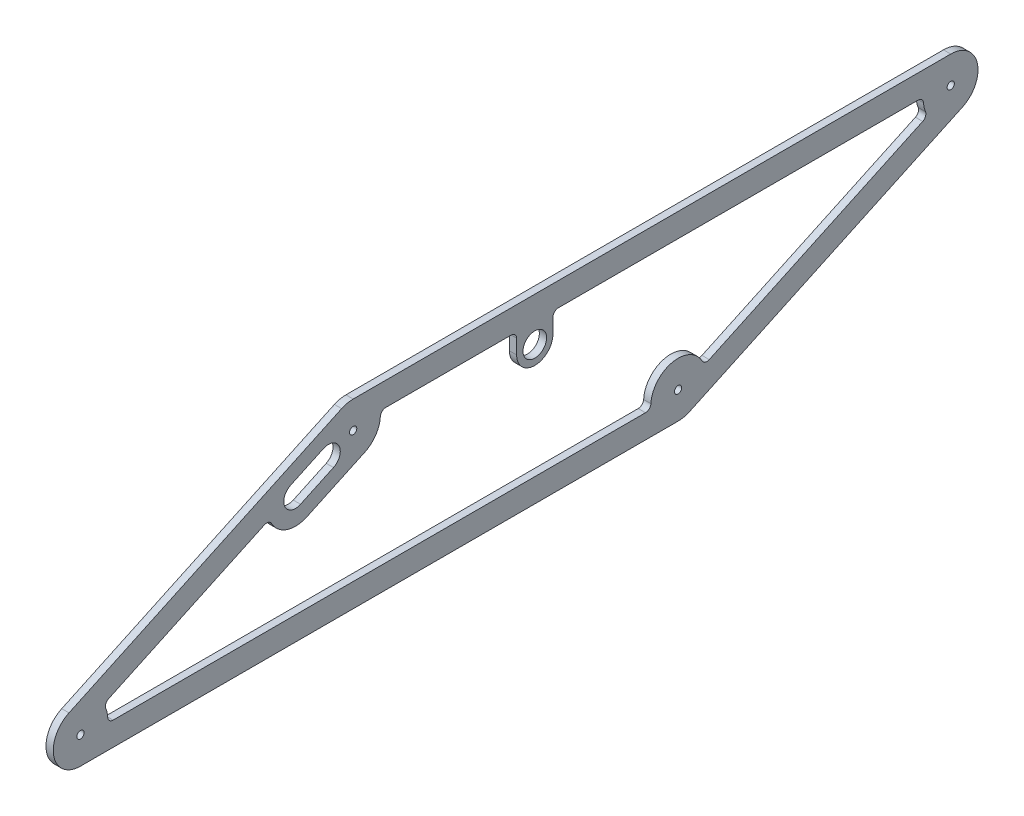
ISO-10303-21;
HEADER;
FILE_DESCRIPTION(('STEP AP214'),'2;1');
FILE_NAME('part.step','',(''),(''),'','','');
FILE_SCHEMA(('AUTOMOTIVE_DESIGN { 1 0 10303 214 1 1 1 1 }'));
ENDSEC;
DATA;
#1=APPLICATION_CONTEXT('core data for automotive mechanical design processes');
#2=APPLICATION_PROTOCOL_DEFINITION('international standard','automotive_design',2000,#1);
#3=PRODUCT_CONTEXT('',#1,'mechanical');
#4=PRODUCT('Part','Part','',(#3));
#5=PRODUCT_RELATED_PRODUCT_CATEGORY('part','',(#4));
#6=PRODUCT_DEFINITION_FORMATION('','',#4);
#7=PRODUCT_DEFINITION_CONTEXT('part definition',#1,'design');
#8=PRODUCT_DEFINITION('design','',#6,#7);
#9=PRODUCT_DEFINITION_SHAPE('','',#8);
#10=(LENGTH_UNIT() NAMED_UNIT(*) SI_UNIT(.MILLI.,.METRE.));
#11=(NAMED_UNIT(*) PLANE_ANGLE_UNIT() SI_UNIT($,.RADIAN.));
#12=(NAMED_UNIT(*) SI_UNIT($,.STERADIAN.) SOLID_ANGLE_UNIT());
#13=UNCERTAINTY_MEASURE_WITH_UNIT(LENGTH_MEASURE(1.E-05),#10,'distance_accuracy_value','');
#14=(GEOMETRIC_REPRESENTATION_CONTEXT(3) GLOBAL_UNCERTAINTY_ASSIGNED_CONTEXT((#13)) GLOBAL_UNIT_ASSIGNED_CONTEXT((#10,
#11,#12)) REPRESENTATION_CONTEXT('',''));
#15=CARTESIAN_POINT('',(0.,0.,0.));
#16=DIRECTION('',(0.,0.,1.));
#17=DIRECTION('',(1.,0.,0.));
#18=AXIS2_PLACEMENT_3D('',#15,#16,#17);
#19=CARTESIAN_POINT('',(-30.,84.9999999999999,182.223888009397));
#20=DIRECTION('',(1.,0.,0.));
#21=DIRECTION('',(0.,0.,-1.));
#22=AXIS2_PLACEMENT_3D('',#19,#20,#21);
#23=CYLINDRICAL_SURFACE('',#22,15.);
#24=CARTESIAN_POINT('',(0.,84.9999999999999,182.223888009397));
#25=DIRECTION('',(-1.,0.,0.));
#26=DIRECTION('',(0.,0.,1.));
#27=AXIS2_PLACEMENT_3D('',#24,#25,#26);
#28=CIRCLE('',#27,15.);
#29=CARTESIAN_POINT('',(0.,84.1666666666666,167.247054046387));
#30=VERTEX_POINT('',#29);
#31=CARTESIAN_POINT('',(0.,71.4053831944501,175.884614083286));
#32=VERTEX_POINT('',#31);
#33=EDGE_CURVE('E478',#30,#32,#28,.T.);
#34=ORIENTED_EDGE('',*,*,#33,.F.);
#35=DIRECTION('',(1.,0.,0.));
#36=VECTOR('',#35,1.);
#37=CARTESIAN_POINT('',(-30.,84.1666666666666,167.247054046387));
#38=LINE('',#37,#36);
#39=CARTESIAN_POINT('',(4.,84.1666666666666,167.247054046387));
#40=VERTEX_POINT('',#39);
#41=EDGE_CURVE('E525',#30,#40,#38,.T.);
#42=ORIENTED_EDGE('',*,*,#41,.T.);
#43=CARTESIAN_POINT('',(4.,84.9999999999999,182.223888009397));
#44=DIRECTION('',(1.,0.,0.));
#45=DIRECTION('',(0.,0.,-1.));
#46=AXIS2_PLACEMENT_3D('',#43,#44,#45);
#47=CIRCLE('',#46,15.);
#48=CARTESIAN_POINT('',(4.,71.4053831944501,175.884614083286));
#49=VERTEX_POINT('',#48);
#50=EDGE_CURVE('E386',#49,#40,#47,.T.);
#51=ORIENTED_EDGE('',*,*,#50,.F.);
#52=DIRECTION('',(1.,0.,0.));
#53=VECTOR('',#52,1.);
#54=CARTESIAN_POINT('',(0.,71.4053831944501,175.884614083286));
#55=LINE('',#54,#53);
#56=EDGE_CURVE('E341',#32,#49,#55,.T.);
#57=ORIENTED_EDGE('',*,*,#56,.F.);
#58=EDGE_LOOP('',(#34,#42,#51,#57));
#59=FACE_BOUND('',#58,.T.);
#60=ADVANCED_FACE('F52',(#59),#23,.T.);
#61=CARTESIAN_POINT('',(-30.,86.9999999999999,0.));
#62=DIRECTION('',(0.,-1.,0.));
#63=DIRECTION('',(0.,0.,-1.));
#64=AXIS2_PLACEMENT_3D('',#61,#62,#63);
#65=PLANE('',#64);
#66=DIRECTION('',(0.,0.,1.));
#67=VECTOR('',#66,1.);
#68=CARTESIAN_POINT('',(0.,86.9999999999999,3.32541993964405));
#69=LINE('',#68,#67);
#70=CARTESIAN_POINT('',(0.,86.9999999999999,95.2238880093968));
#71=VERTEX_POINT('',#70);
#72=CARTESIAN_POINT('',(0.,86.9999999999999,164.251687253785));
#73=VERTEX_POINT('',#72);
#74=EDGE_CURVE('E474',#71,#73,#69,.T.);
#75=ORIENTED_EDGE('',*,*,#74,.F.);
#76=DIRECTION('',(1.,0.,0.));
#77=VECTOR('',#76,1.);
#78=CARTESIAN_POINT('',(-30.,86.9999999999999,95.2238880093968));
#79=LINE('',#78,#77);
#80=CARTESIAN_POINT('',(4.,86.9999999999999,95.2238880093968));
#81=VERTEX_POINT('',#80);
#82=EDGE_CURVE('E517',#71,#81,#79,.T.);
#83=ORIENTED_EDGE('',*,*,#82,.T.);
#84=DIRECTION('',(0.,0.,-1.));
#85=VECTOR('',#84,1.);
#86=CARTESIAN_POINT('',(4.,86.9999999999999,0.));
#87=LINE('',#86,#85);
#88=CARTESIAN_POINT('',(4.,86.9999999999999,164.251687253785));
#89=VERTEX_POINT('',#88);
#90=EDGE_CURVE('E383',#89,#81,#87,.T.);
#91=ORIENTED_EDGE('',*,*,#90,.F.);
#92=DIRECTION('',(-1.,0.,0.));
#93=VECTOR('',#92,1.);
#94=CARTESIAN_POINT('',(0.,86.9999999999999,164.251687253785));
#95=LINE('',#94,#93);
#96=EDGE_CURVE('E515',#89,#73,#95,.T.);
#97=ORIENTED_EDGE('',*,*,#96,.T.);
#98=EDGE_LOOP('',(#75,#83,#91,#97));
#99=FACE_BOUND('',#98,.T.);
#100=ADVANCED_FACE('F648',(#99),#65,.T.);
#101=CARTESIAN_POINT('',(0.,86.9999999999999,-128.817863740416));
#102=VERTEX_POINT('',#101);
#103=CARTESIAN_POINT('',(0.,86.9999999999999,69.2238880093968));
#104=VERTEX_POINT('',#103);
#105=EDGE_CURVE('E477',#102,#104,#69,.T.);
#106=ORIENTED_EDGE('',*,*,#105,.F.);
#107=DIRECTION('',(-1.,0.,0.));
#108=VECTOR('',#107,1.);
#109=CARTESIAN_POINT('',(4.,86.9999999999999,-128.817863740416));
#110=LINE('',#109,#108);
#111=CARTESIAN_POINT('',(4.,86.9999999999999,-128.817863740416));
#112=VERTEX_POINT('',#111);
#113=EDGE_CURVE('E492',#102,#112,#110,.F.);
#114=ORIENTED_EDGE('',*,*,#113,.T.);
#115=CARTESIAN_POINT('',(4.,86.9999999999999,69.2238880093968));
#116=VERTEX_POINT('',#115);
#117=EDGE_CURVE('E382',#116,#112,#87,.T.);
#118=ORIENTED_EDGE('',*,*,#117,.F.);
#119=DIRECTION('',(1.,0.,0.));
#120=VECTOR('',#119,1.);
#121=CARTESIAN_POINT('',(-30.,86.9999999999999,69.2238880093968));
#122=LINE('',#121,#120);
#123=EDGE_CURVE('E490',#116,#104,#122,.F.);
#124=ORIENTED_EDGE('',*,*,#123,.T.);
#125=EDGE_LOOP('',(#106,#114,#118,#124));
#126=FACE_BOUND('',#125,.T.);
#127=ADVANCED_FACE('F622',(#126),#65,.T.);
#128=CARTESIAN_POINT('',(4.,15.,3.32541993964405));
#129=DIRECTION('',(-1.,0.,0.));
#130=DIRECTION('',(0.,0.,1.));
#131=AXIS2_PLACEMENT_3D('',#128,#129,#130);
#132=PLANE('',#131);
#133=CARTESIAN_POINT('',(4.,15.,3.32541993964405));
#134=DIRECTION('',(-1.,0.,0.));
#135=DIRECTION('',(0.,0.,1.));
#136=AXIS2_PLACEMENT_3D('',#133,#134,#135);
#137=CIRCLE('',#136,2.);
#138=CARTESIAN_POINT('',(4.,15.,5.32541993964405));
#139=VERTEX_POINT('',#138);
#140=EDGE_CURVE('E316',#139,#139,#137,.T.);
#141=ORIENTED_EDGE('',*,*,#140,.T.);
#142=EDGE_LOOP('',(#141));
#143=FACE_BOUND('',#142,.T.);
#144=CARTESIAN_POINT('',(4.,85.,-146.790064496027));
#145=DIRECTION('',(-1.,0.,0.));
#146=DIRECTION('',(0.,0.,1.));
#147=AXIS2_PLACEMENT_3D('',#144,#145,#146);
#148=CIRCLE('',#147,2.);
#149=CARTESIAN_POINT('',(4.,85.,-144.790064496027));
#150=VERTEX_POINT('',#149);
#151=EDGE_CURVE('E1133',#150,#150,#148,.T.);
#152=ORIENTED_EDGE('',*,*,#151,.T.);
#153=EDGE_LOOP('',(#152));
#154=FACE_BOUND('',#153,.T.);
#155=DIRECTION('',(0.,0.422618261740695,-0.906307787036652));
#156=VECTOR('',#155,1.);
#157=CARTESIAN_POINT('',(4.,64.3173602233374,211.197641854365));
#158=LINE('',#157,#156);
#159=CARTESIAN_POINT('',(4.,64.3173602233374,211.197641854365));
#160=VERTEX_POINT('',#159);
#161=CARTESIAN_POINT('',(4.,72.7697254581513,193.071486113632));
#162=VERTEX_POINT('',#161);
#163=EDGE_CURVE('E322',#160,#162,#158,.T.);
#164=ORIENTED_EDGE('',*,*,#163,.F.);
#165=CARTESIAN_POINT('',(4.,70.2083608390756,213.94466055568));
#166=DIRECTION('',(1.,0.,0.));
#167=DIRECTION('',(0.,0.,-1.));
#168=AXIS2_PLACEMENT_3D('',#165,#166,#167);
#169=CIRCLE('',#168,6.5);
#170=CARTESIAN_POINT('',(4.,76.0993614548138,216.691679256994));
#171=VERTEX_POINT('',#170);
#172=EDGE_CURVE('E293',#171,#160,#169,.T.);
#173=ORIENTED_EDGE('',*,*,#172,.F.);
#174=DIRECTION('',(0.,-0.422618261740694,0.906307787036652));
#175=VECTOR('',#174,1.);
#176=CARTESIAN_POINT('',(4.,76.0993614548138,216.691679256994));
#177=LINE('',#176,#175);
#178=CARTESIAN_POINT('',(4.,84.5517266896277,198.565523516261));
#179=VERTEX_POINT('',#178);
#180=EDGE_CURVE('E310',#179,#171,#177,.T.);
#181=ORIENTED_EDGE('',*,*,#180,.F.);
#182=CARTESIAN_POINT('',(4.,78.6607260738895,195.818504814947));
#183=DIRECTION('',(1.,0.,0.));
#184=DIRECTION('',(0.,0.,-1.));
#185=AXIS2_PLACEMENT_3D('',#182,#183,#184);
#186=CIRCLE('',#185,6.49999999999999);
#187=EDGE_CURVE('E313',#162,#179,#186,.T.);
#188=ORIENTED_EDGE('',*,*,#187,.F.);
#189=EDGE_LOOP('',(#164,#173,#181,#188));
#190=FACE_BOUND('',#189,.T.);
#191=CARTESIAN_POINT('',(4.,76.,82.2238880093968));
#192=DIRECTION('',(1.,0.,0.));
#193=DIRECTION('',(0.,0.,-1.));
#194=AXIS2_PLACEMENT_3D('',#191,#192,#193);
#195=CIRCLE('',#194,6.5);
#196=CARTESIAN_POINT('',(4.,76.,75.7238880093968));
#197=VERTEX_POINT('',#196);
#198=EDGE_CURVE('E344',#197,#197,#195,.T.);
#199=ORIENTED_EDGE('',*,*,#198,.F.);
#200=EDGE_LOOP('',(#199));
#201=FACE_BOUND('',#200,.T.);
#202=CARTESIAN_POINT('',(4.,15.,3.32541993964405));
#203=DIRECTION('',(1.,0.,0.));
#204=DIRECTION('',(0.,0.,1.));
#205=AXIS2_PLACEMENT_3D('',#202,#203,#204);
#206=CIRCLE('',#205,15.);
#207=CARTESIAN_POINT('',(4.,0.,3.3254199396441));
#208=VERTEX_POINT('',#207);
#209=CARTESIAN_POINT('',(4.,1.40538319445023,-3.01385398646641));
#210=VERTEX_POINT('',#209);
#211=EDGE_CURVE('E408',#208,#210,#206,.T.);
#212=ORIENTED_EDGE('',*,*,#211,.T.);
#213=DIRECTION('',(0.,0.422618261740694,-0.906307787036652));
#214=VECTOR('',#213,1.);
#215=CARTESIAN_POINT('',(4.,1.40538319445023,-3.01385398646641));
#216=LINE('',#215,#214);
#217=CARTESIAN_POINT('',(4.,71.4053831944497,-153.129338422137));
#218=VERTEX_POINT('',#217);
#219=EDGE_CURVE('E411',#210,#218,#216,.T.);
#220=ORIENTED_EDGE('',*,*,#219,.T.);
#221=CARTESIAN_POINT('',(4.,85.,-146.790064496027));
#222=DIRECTION('',(1.,0.,0.));
#223=DIRECTION('',(0.,0.,-1.));
#224=AXIS2_PLACEMENT_3D('',#221,#222,#223);
#225=CIRCLE('',#224,15.);
#226=CARTESIAN_POINT('',(4.,99.9999999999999,-146.790064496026));
#227=VERTEX_POINT('',#226);
#228=EDGE_CURVE('E414',#218,#227,#225,.T.);
#229=ORIENTED_EDGE('',*,*,#228,.T.);
#230=DIRECTION('',(0.,0.,1.));
#231=VECTOR('',#230,1.);
#232=CARTESIAN_POINT('',(4.,99.9999999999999,-146.790064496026));
#233=LINE('',#232,#231);
#234=CARTESIAN_POINT('',(4.,99.9999999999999,182.223888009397));
#235=VERTEX_POINT('',#234);
#236=EDGE_CURVE('E416',#227,#235,#233,.T.);
#237=ORIENTED_EDGE('',*,*,#236,.T.);
#238=CARTESIAN_POINT('',(4.,84.9999999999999,182.223888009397));
#239=DIRECTION('',(1.,0.,0.));
#240=DIRECTION('',(0.,0.,1.));
#241=AXIS2_PLACEMENT_3D('',#238,#239,#240);
#242=CIRCLE('',#241,15.);
#243=CARTESIAN_POINT('',(4.,98.5946168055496,188.563161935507));
#244=VERTEX_POINT('',#243);
#245=EDGE_CURVE('E418',#235,#244,#242,.T.);
#246=ORIENTED_EDGE('',*,*,#245,.T.);
#247=DIRECTION('',(0.,-0.422618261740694,0.906307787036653));
#248=VECTOR('',#247,1.);
#249=CARTESIAN_POINT('',(4.,28.5946168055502,338.678646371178));
#250=LINE('',#249,#248);
#251=CARTESIAN_POINT('',(4.,28.5946168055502,338.678646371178));
#252=VERTEX_POINT('',#251);
#253=EDGE_CURVE('E420',#244,#252,#250,.T.);
#254=ORIENTED_EDGE('',*,*,#253,.T.);
#255=CARTESIAN_POINT('',(4.,15.,332.339372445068));
#256=DIRECTION('',(1.,0.,0.));
#257=DIRECTION('',(0.,0.,1.));
#258=AXIS2_PLACEMENT_3D('',#255,#256,#257);
#259=CIRCLE('',#258,15.);
#260=CARTESIAN_POINT('',(4.,0.,332.339372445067));
#261=VERTEX_POINT('',#260);
#262=EDGE_CURVE('E422',#252,#261,#259,.T.);
#263=ORIENTED_EDGE('',*,*,#262,.T.);
#264=DIRECTION('',(0.,0.,-1.));
#265=VECTOR('',#264,1.);
#266=CARTESIAN_POINT('',(4.,0.,3.3254199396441));
#267=LINE('',#266,#265);
#268=EDGE_CURVE('E424',#261,#208,#267,.T.);
#269=ORIENTED_EDGE('',*,*,#268,.T.);
#270=EDGE_LOOP('',(#212,#220,#229,#237,#246,#254,#263,#269));
#271=FACE_BOUND('',#270,.T.);
#272=CARTESIAN_POINT('',(4.,15.,332.339372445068));
#273=DIRECTION('',(1.,0.,0.));
#274=DIRECTION('',(0.,0.,-1.));
#275=AXIS2_PLACEMENT_3D('',#272,#273,#274);
#276=CIRCLE('',#275,2.);
#277=CARTESIAN_POINT('',(4.,15.,330.339372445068));
#278=VERTEX_POINT('',#277);
#279=EDGE_CURVE('E404',#278,#278,#276,.T.);
#280=ORIENTED_EDGE('',*,*,#279,.F.);
#281=EDGE_LOOP('',(#280));
#282=FACE_BOUND('',#281,.T.);
#283=CARTESIAN_POINT('',(4.,84.9999999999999,182.223888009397));
#284=DIRECTION('',(-1.,0.,0.));
#285=DIRECTION('',(0.,0.,1.));
#286=AXIS2_PLACEMENT_3D('',#283,#284,#285);
#287=CIRCLE('',#286,2.);
#288=CARTESIAN_POINT('',(4.,84.9999999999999,184.223888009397));
#289=VERTEX_POINT('',#288);
#290=EDGE_CURVE('E401',#289,#289,#287,.T.);
#291=ORIENTED_EDGE('',*,*,#290,.T.);
#292=EDGE_LOOP('',(#291));
#293=FACE_BOUND('',#292,.T.);
#294=DIRECTION('',(0.,0.422618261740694,-0.906307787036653));
#295=VECTOR('',#294,1.);
#296=CARTESIAN_POINT('',(4.,11.7820012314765,5.49403740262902));
#297=LINE('',#296,#295);
#298=CARTESIAN_POINT('',(4.,20.782764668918,-13.808162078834));
#299=VERTEX_POINT('',#298);
#300=CARTESIAN_POINT('',(4.,75.5920041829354,-131.346955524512));
#301=VERTEX_POINT('',#300);
#302=EDGE_CURVE('E376',#299,#301,#297,.T.);
#303=ORIENTED_EDGE('',*,*,#302,.F.);
#304=CARTESIAN_POINT('',(4.,23.501688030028,-12.5403072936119));
#305=DIRECTION('',(-1.,0.,0.));
#306=DIRECTION('',(0.,0.,1.));
#307=AXIS2_PLACEMENT_3D('',#304,#305,#306);
#308=CIRCLE('',#307,3.);
#309=CARTESIAN_POINT('',(4.,22.0847400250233,-9.89601942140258));
#310=VERTEX_POINT('',#309);
#311=EDGE_CURVE('E547',#299,#310,#308,.T.);
#312=ORIENTED_EDGE('',*,*,#311,.T.);
#313=CARTESIAN_POINT('',(4.,15.,3.32541993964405));
#314=DIRECTION('',(1.,0.,0.));
#315=DIRECTION('',(0.,0.,-1.));
#316=AXIS2_PLACEMENT_3D('',#313,#314,#315);
#317=CIRCLE('',#316,15.);
#318=CARTESIAN_POINT('',(4.,15.8333333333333,18.3022539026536));
#319=VERTEX_POINT('',#318);
#320=EDGE_CURVE('E371',#310,#319,#317,.T.);
#321=ORIENTED_EDGE('',*,*,#320,.T.);
#322=CARTESIAN_POINT('',(4.,16.,21.2976206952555));
#323=DIRECTION('',(-1.,0.,0.));
#324=DIRECTION('',(0.,0.,1.));
#325=AXIS2_PLACEMENT_3D('',#322,#323,#324);
#326=CIRCLE('',#325,3.);
#327=CARTESIAN_POINT('',(4.,13.,21.2976206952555));
#328=VERTEX_POINT('',#327);
#329=EDGE_CURVE('E551',#319,#328,#326,.T.);
#330=ORIENTED_EDGE('',*,*,#329,.T.);
#331=DIRECTION('',(0.,0.,1.));
#332=VECTOR('',#331,1.);
#333=CARTESIAN_POINT('',(4.,13.,0.));
#334=LINE('',#333,#332);
#335=CARTESIAN_POINT('',(4.,13.,314.367171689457));
#336=VERTEX_POINT('',#335);
#337=EDGE_CURVE('E395',#328,#336,#334,.T.);
#338=ORIENTED_EDGE('',*,*,#337,.T.);
#339=CARTESIAN_POINT('',(4.,16.,314.367171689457));
#340=DIRECTION('',(-1.,0.,0.));
#341=DIRECTION('',(0.,0.,1.));
#342=AXIS2_PLACEMENT_3D('',#339,#340,#341);
#343=CIRCLE('',#342,3.);
#344=CARTESIAN_POINT('',(4.,15.8333333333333,317.362538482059));
#345=VERTEX_POINT('',#344);
#346=EDGE_CURVE('E60',#336,#345,#343,.T.);
#347=ORIENTED_EDGE('',*,*,#346,.T.);
#348=CARTESIAN_POINT('',(4.,15.,332.339372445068));
#349=DIRECTION('',(1.,0.,0.));
#350=DIRECTION('',(0.,0.,-1.));
#351=AXIS2_PLACEMENT_3D('',#348,#349,#350);
#352=CIRCLE('',#351,15.);
#353=CARTESIAN_POINT('',(4.,20.5742270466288,318.413569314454));
#354=VERTEX_POINT('',#353);
#355=EDGE_CURVE('E392',#345,#354,#352,.T.);
#356=ORIENTED_EDGE('',*,*,#355,.T.);
#357=CARTESIAN_POINT('',(4.,21.6890724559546,315.628408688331));
#358=DIRECTION('',(-1.,0.,0.));
#359=DIRECTION('',(0.,0.,1.));
#360=AXIS2_PLACEMENT_3D('',#357,#358,#359);
#361=CIRCLE('',#360,3.);
#362=CARTESIAN_POINT('',(4.,24.4079958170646,316.896263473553));
#363=VERTEX_POINT('',#362);
#364=EDGE_CURVE('E571',#354,#363,#361,.T.);
#365=ORIENTED_EDGE('',*,*,#364,.T.);
#366=DIRECTION('',(0.,0.422618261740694,-0.906307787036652));
#367=VECTOR('',#366,1.);
#368=CARTESIAN_POINT('',(4.,141.426887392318,65.9484406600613));
#369=LINE('',#368,#367);
#370=CARTESIAN_POINT('',(4.,64.4255961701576,231.078242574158));
#371=VERTEX_POINT('',#370);
#372=EDGE_CURVE('E389',#363,#371,#369,.T.);
#373=ORIENTED_EDGE('',*,*,#372,.T.);
#374=CARTESIAN_POINT('',(4.,61.7066728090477,229.810387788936));
#375=DIRECTION('',(-1.,0.,0.));
#376=DIRECTION('',(0.,0.,1.));
#377=AXIS2_PLACEMENT_3D('',#374,#375,#376);
#378=CIRCLE('',#377,3.);
#379=CARTESIAN_POINT('',(4.,63.1236208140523,227.166099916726));
#380=VERTEX_POINT('',#379);
#381=EDGE_CURVE('E567',#371,#380,#378,.T.);
#382=ORIENTED_EDGE('',*,*,#381,.T.);
#383=CARTESIAN_POINT('',(4.,70.2083608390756,213.94466055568));
#384=DIRECTION('',(1.,0.,0.));
#385=DIRECTION('',(0.,0.,-1.));
#386=AXIS2_PLACEMENT_3D('',#383,#384,#385);
#387=CIRCLE('',#386,15.);
#388=CARTESIAN_POINT('',(4.,56.6137440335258,207.605386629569));
#389=VERTEX_POINT('',#388);
#390=EDGE_CURVE('E328',#380,#389,#387,.T.);
#391=ORIENTED_EDGE('',*,*,#390,.T.);
#392=DIRECTION('',(0.,0.422618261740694,-0.906307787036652));
#393=VECTOR('',#392,1.);
#394=CARTESIAN_POINT('',(4.,126.019655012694,58.7639302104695));
#395=LINE('',#394,#393);
#396=EDGE_CURVE('E335',#389,#49,#395,.T.);
#397=ORIENTED_EDGE('',*,*,#396,.T.);
#398=ORIENTED_EDGE('',*,*,#50,.T.);
#399=CARTESIAN_POINT('',(4.,83.9999999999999,164.251687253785));
#400=DIRECTION('',(-1.,0.,0.));
#401=DIRECTION('',(0.,0.,1.));
#402=AXIS2_PLACEMENT_3D('',#399,#400,#401);
#403=CIRCLE('',#402,3.);
#404=EDGE_CURVE('E563',#40,#89,#403,.T.);
#405=ORIENTED_EDGE('',*,*,#404,.T.);
#406=ORIENTED_EDGE('',*,*,#90,.T.);
#407=CARTESIAN_POINT('',(4.,83.9999999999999,95.2238880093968));
#408=DIRECTION('',(-1.,0.,0.));
#409=DIRECTION('',(0.,0.,1.));
#410=AXIS2_PLACEMENT_3D('',#407,#408,#409);
#411=CIRCLE('',#410,3.);
#412=CARTESIAN_POINT('',(4.,83.9999999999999,92.2238880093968));
#413=VERTEX_POINT('',#412);
#414=EDGE_CURVE('E555',#81,#413,#411,.T.);
#415=ORIENTED_EDGE('',*,*,#414,.T.);
#416=DIRECTION('',(0.,1.,0.));
#417=VECTOR('',#416,1.);
#418=CARTESIAN_POINT('',(4.,0.,92.2238880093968));
#419=LINE('',#418,#417);
#420=CARTESIAN_POINT('',(4.,76.,92.2238880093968));
#421=VERTEX_POINT('',#420);
#422=EDGE_CURVE('E357',#421,#413,#419,.T.);
#423=ORIENTED_EDGE('',*,*,#422,.F.);
#424=CARTESIAN_POINT('',(4.,76.,82.2238880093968));
#425=DIRECTION('',(1.,0.,0.));
#426=DIRECTION('',(0.,0.,-1.));
#427=AXIS2_PLACEMENT_3D('',#424,#425,#426);
#428=CIRCLE('',#427,9.99999999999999);
#429=CARTESIAN_POINT('',(4.,76.,72.2238880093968));
#430=VERTEX_POINT('',#429);
#431=EDGE_CURVE('E350',#421,#430,#428,.T.);
#432=ORIENTED_EDGE('',*,*,#431,.T.);
#433=DIRECTION('',(0.,-1.,0.));
#434=VECTOR('',#433,1.);
#435=CARTESIAN_POINT('',(4.,0.,72.2238880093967));
#436=LINE('',#435,#434);
#437=CARTESIAN_POINT('',(4.,83.9999999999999,72.2238880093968));
#438=VERTEX_POINT('',#437);
#439=EDGE_CURVE('E365',#438,#430,#436,.T.);
#440=ORIENTED_EDGE('',*,*,#439,.F.);
#441=CARTESIAN_POINT('',(4.,83.9999999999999,69.2238880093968));
#442=DIRECTION('',(-1.,0.,0.));
#443=DIRECTION('',(0.,0.,1.));
#444=AXIS2_PLACEMENT_3D('',#441,#442,#443);
#445=CIRCLE('',#444,3.);
#446=EDGE_CURVE('E559',#438,#116,#445,.T.);
#447=ORIENTED_EDGE('',*,*,#446,.T.);
#448=ORIENTED_EDGE('',*,*,#117,.T.);
#449=CARTESIAN_POINT('',(4.,83.9999999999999,-128.817863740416));
#450=DIRECTION('',(-1.,0.,0.));
#451=DIRECTION('',(0.,0.,1.));
#452=AXIS2_PLACEMENT_3D('',#449,#450,#451);
#453=CIRCLE('',#452,3.);
#454=CARTESIAN_POINT('',(4.,84.1666666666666,-131.813230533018));
#455=VERTEX_POINT('',#454);
#456=EDGE_CURVE('E539',#112,#455,#453,.T.);
#457=ORIENTED_EDGE('',*,*,#456,.T.);
#458=CARTESIAN_POINT('',(4.,85.,-146.790064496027));
#459=DIRECTION('',(1.,0.,0.));
#460=DIRECTION('',(0.,0.,-1.));
#461=AXIS2_PLACEMENT_3D('',#458,#459,#460);
#462=CIRCLE('',#461,15.);
#463=CARTESIAN_POINT('',(4.,79.4257729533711,-132.864261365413));
#464=VERTEX_POINT('',#463);
#465=EDGE_CURVE('E379',#455,#464,#462,.T.);
#466=ORIENTED_EDGE('',*,*,#465,.T.);
#467=CARTESIAN_POINT('',(4.,78.3109275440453,-130.07910073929));
#468=DIRECTION('',(-1.,0.,0.));
#469=DIRECTION('',(0.,0.,1.));
#470=AXIS2_PLACEMENT_3D('',#467,#468,#469);
#471=CIRCLE('',#470,3.);
#472=EDGE_CURVE('E543',#464,#301,#471,.T.);
#473=ORIENTED_EDGE('',*,*,#472,.T.);
#474=EDGE_LOOP('',(#303,#312,#321,#330,#338,#347,#356,#365,#373,#382,#391,#397,#398,#405,#406,
#415,#423,#432,#440,#447,#448,#457,#466,#473));
#475=FACE_BOUND('',#474,.T.);
#476=ADVANCED_FACE('F575',(#143,#154,#190,#201,#271,#282,#293,#475),#132,.F.);
#477=CARTESIAN_POINT('',(0.,15.,3.32541993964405));
#478=DIRECTION('',(-1.,0.,0.));
#479=DIRECTION('',(0.,0.,1.));
#480=AXIS2_PLACEMENT_3D('',#477,#478,#479);
#481=PLANE('',#480);
#482=CARTESIAN_POINT('',(0.,15.,3.32541993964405));
#483=DIRECTION('',(-1.,0.,0.));
#484=DIRECTION('',(0.,0.,1.));
#485=AXIS2_PLACEMENT_3D('',#482,#483,#484);
#486=CIRCLE('',#485,2.);
#487=CARTESIAN_POINT('',(0.,15.,5.32541993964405));
#488=VERTEX_POINT('',#487);
#489=EDGE_CURVE('E1135',#488,#488,#486,.T.);
#490=ORIENTED_EDGE('',*,*,#489,.F.);
#491=EDGE_LOOP('',(#490));
#492=FACE_BOUND('',#491,.T.);
#493=CARTESIAN_POINT('',(0.,85.,-146.790064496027));
#494=DIRECTION('',(-1.,0.,0.));
#495=DIRECTION('',(0.,0.,1.));
#496=AXIS2_PLACEMENT_3D('',#493,#494,#495);
#497=CIRCLE('',#496,2.);
#498=CARTESIAN_POINT('',(0.,85.,-144.790064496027));
#499=VERTEX_POINT('',#498);
#500=EDGE_CURVE('E1130',#499,#499,#497,.T.);
#501=ORIENTED_EDGE('',*,*,#500,.F.);
#502=EDGE_LOOP('',(#501));
#503=FACE_BOUND('',#502,.T.);
#504=CARTESIAN_POINT('',(0.,70.2083608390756,213.94466055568));
#505=DIRECTION('',(1.,0.,0.));
#506=DIRECTION('',(0.,0.,-1.));
#507=AXIS2_PLACEMENT_3D('',#504,#505,#506);
#508=CIRCLE('',#507,6.5);
#509=CARTESIAN_POINT('',(0.,76.0993614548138,216.691679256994));
#510=VERTEX_POINT('',#509);
#511=CARTESIAN_POINT('',(0.,64.3173602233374,211.197641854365));
#512=VERTEX_POINT('',#511);
#513=EDGE_CURVE('E290',#510,#512,#508,.T.);
#514=ORIENTED_EDGE('',*,*,#513,.T.);
#515=DIRECTION('',(0.,0.422618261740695,-0.906307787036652));
#516=VECTOR('',#515,1.);
#517=CARTESIAN_POINT('',(0.,64.3173602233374,211.197641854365));
#518=LINE('',#517,#516);
#519=CARTESIAN_POINT('',(0.,72.7697254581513,193.071486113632));
#520=VERTEX_POINT('',#519);
#521=EDGE_CURVE('E302',#512,#520,#518,.T.);
#522=ORIENTED_EDGE('',*,*,#521,.T.);
#523=CARTESIAN_POINT('',(0.,78.6607260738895,195.818504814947));
#524=DIRECTION('',(1.,0.,0.));
#525=DIRECTION('',(0.,0.,-1.));
#526=AXIS2_PLACEMENT_3D('',#523,#524,#525);
#527=CIRCLE('',#526,6.49999999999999);
#528=CARTESIAN_POINT('',(0.,84.5517266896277,198.565523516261));
#529=VERTEX_POINT('',#528);
#530=EDGE_CURVE('E306',#520,#529,#527,.T.);
#531=ORIENTED_EDGE('',*,*,#530,.T.);
#532=DIRECTION('',(0.,-0.422618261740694,0.906307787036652));
#533=VECTOR('',#532,1.);
#534=CARTESIAN_POINT('',(0.,76.0993614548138,216.691679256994));
#535=LINE('',#534,#533);
#536=EDGE_CURVE('E298',#529,#510,#535,.T.);
#537=ORIENTED_EDGE('',*,*,#536,.T.);
#538=EDGE_LOOP('',(#514,#522,#531,#537));
#539=FACE_BOUND('',#538,.T.);
#540=CARTESIAN_POINT('',(0.,70.2083608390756,213.94466055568));
#541=DIRECTION('',(1.,0.,0.));
#542=DIRECTION('',(0.,0.,-1.));
#543=AXIS2_PLACEMENT_3D('',#540,#541,#542);
#544=CIRCLE('',#543,15.);
#545=CARTESIAN_POINT('',(0.,63.1236208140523,227.166099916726));
#546=VERTEX_POINT('',#545);
#547=CARTESIAN_POINT('',(0.,56.6137440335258,207.605386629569));
#548=VERTEX_POINT('',#547);
#549=EDGE_CURVE('E332',#546,#548,#544,.T.);
#550=ORIENTED_EDGE('',*,*,#549,.F.);
#551=CARTESIAN_POINT('',(0.,61.7066728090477,229.810387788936));
#552=DIRECTION('',(-1.,0.,0.));
#553=DIRECTION('',(0.,0.,1.));
#554=AXIS2_PLACEMENT_3D('',#551,#552,#553);
#555=CIRCLE('',#554,3.);
#556=CARTESIAN_POINT('',(0.,64.4255961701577,231.078242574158));
#557=VERTEX_POINT('',#556);
#558=EDGE_CURVE('E569',#546,#557,#555,.F.);
#559=ORIENTED_EDGE('',*,*,#558,.T.);
#560=DIRECTION('',(0.,-0.422618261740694,0.906307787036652));
#561=VECTOR('',#560,1.);
#562=CARTESIAN_POINT('',(0.,142.832270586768,62.9345866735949));
#563=LINE('',#562,#561);
#564=CARTESIAN_POINT('',(0.,24.4079958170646,316.896263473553));
#565=VERTEX_POINT('',#564);
#566=EDGE_CURVE('E480',#557,#565,#563,.T.);
#567=ORIENTED_EDGE('',*,*,#566,.T.);
#568=CARTESIAN_POINT('',(0.,21.6890724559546,315.628408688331));
#569=DIRECTION('',(-1.,0.,0.));
#570=DIRECTION('',(0.,0.,1.));
#571=AXIS2_PLACEMENT_3D('',#568,#569,#570);
#572=CIRCLE('',#571,3.);
#573=CARTESIAN_POINT('',(0.,20.5742270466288,318.413569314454));
#574=VERTEX_POINT('',#573);
#575=EDGE_CURVE('E74',#565,#574,#572,.F.);
#576=ORIENTED_EDGE('',*,*,#575,.T.);
#577=CARTESIAN_POINT('',(0.,15.,332.339372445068));
#578=DIRECTION('',(-1.,0.,0.));
#579=DIRECTION('',(0.,0.,1.));
#580=AXIS2_PLACEMENT_3D('',#577,#578,#579);
#581=CIRCLE('',#580,15.);
#582=CARTESIAN_POINT('',(0.,15.8333333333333,317.362538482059));
#583=VERTEX_POINT('',#582);
#584=EDGE_CURVE('E482',#574,#583,#581,.T.);
#585=ORIENTED_EDGE('',*,*,#584,.T.);
#586=CARTESIAN_POINT('',(0.,16.,314.367171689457));
#587=DIRECTION('',(-1.,0.,0.));
#588=DIRECTION('',(0.,0.,1.));
#589=AXIS2_PLACEMENT_3D('',#586,#587,#588);
#590=CIRCLE('',#589,3.);
#591=CARTESIAN_POINT('',(0.,13.,314.367171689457));
#592=VERTEX_POINT('',#591);
#593=EDGE_CURVE('E12',#583,#592,#590,.F.);
#594=ORIENTED_EDGE('',*,*,#593,.T.);
#595=DIRECTION('',(0.,0.,-1.));
#596=VECTOR('',#595,1.);
#597=CARTESIAN_POINT('',(0.,13.,3.32541993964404));
#598=LINE('',#597,#596);
#599=CARTESIAN_POINT('',(0.,13.,21.2976206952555));
#600=VERTEX_POINT('',#599);
#601=EDGE_CURVE('E484',#592,#600,#598,.T.);
#602=ORIENTED_EDGE('',*,*,#601,.T.);
#603=CARTESIAN_POINT('',(0.,16.,21.2976206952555));
#604=DIRECTION('',(-1.,0.,0.));
#605=DIRECTION('',(0.,0.,1.));
#606=AXIS2_PLACEMENT_3D('',#603,#604,#605);
#607=CIRCLE('',#606,3.);
#608=CARTESIAN_POINT('',(0.,15.8333333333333,18.3022539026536));
#609=VERTEX_POINT('',#608);
#610=EDGE_CURVE('E553',#600,#609,#607,.F.);
#611=ORIENTED_EDGE('',*,*,#610,.T.);
#612=CARTESIAN_POINT('',(0.,15.,3.32541993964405));
#613=DIRECTION('',(-1.,0.,0.));
#614=DIRECTION('',(0.,0.,1.));
#615=AXIS2_PLACEMENT_3D('',#612,#613,#614);
#616=CIRCLE('',#615,15.);
#617=CARTESIAN_POINT('',(0.,22.0847400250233,-9.89601942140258));
#618=VERTEX_POINT('',#617);
#619=EDGE_CURVE('E487',#609,#618,#616,.T.);
#620=ORIENTED_EDGE('',*,*,#619,.T.);
#621=CARTESIAN_POINT('',(0.,23.501688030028,-12.5403072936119));
#622=DIRECTION('',(-1.,0.,0.));
#623=DIRECTION('',(0.,0.,1.));
#624=AXIS2_PLACEMENT_3D('',#621,#622,#623);
#625=CIRCLE('',#624,3.);
#626=CARTESIAN_POINT('',(0.,20.782764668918,-13.808162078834));
#627=VERTEX_POINT('',#626);
#628=EDGE_CURVE('E549',#618,#627,#625,.F.);
#629=ORIENTED_EDGE('',*,*,#628,.T.);
#630=DIRECTION('',(0.,-0.422618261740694,0.906307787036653));
#631=VECTOR('',#630,1.);
#632=CARTESIAN_POINT('',(0.,13.1873844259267,2.48018341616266));
#633=LINE('',#632,#631);
#634=CARTESIAN_POINT('',(0.,75.5920041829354,-131.346955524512));
#635=VERTEX_POINT('',#634);
#636=EDGE_CURVE('E466',#635,#627,#633,.T.);
#637=ORIENTED_EDGE('',*,*,#636,.F.);
#638=CARTESIAN_POINT('',(0.,78.3109275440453,-130.07910073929));
#639=DIRECTION('',(-1.,0.,0.));
#640=DIRECTION('',(0.,0.,1.));
#641=AXIS2_PLACEMENT_3D('',#638,#639,#640);
#642=CIRCLE('',#641,3.);
#643=CARTESIAN_POINT('',(0.,79.4257729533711,-132.864261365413));
#644=VERTEX_POINT('',#643);
#645=EDGE_CURVE('E545',#635,#644,#642,.F.);
#646=ORIENTED_EDGE('',*,*,#645,.T.);
#647=CARTESIAN_POINT('',(0.,85.,-146.790064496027));
#648=DIRECTION('',(-1.,0.,0.));
#649=DIRECTION('',(0.,0.,1.));
#650=AXIS2_PLACEMENT_3D('',#647,#648,#649);
#651=CIRCLE('',#650,15.);
#652=CARTESIAN_POINT('',(0.,84.1666666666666,-131.813230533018));
#653=VERTEX_POINT('',#652);
#654=EDGE_CURVE('E471',#644,#653,#651,.T.);
#655=ORIENTED_EDGE('',*,*,#654,.T.);
#656=CARTESIAN_POINT('',(0.,83.9999999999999,-128.817863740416));
#657=DIRECTION('',(-1.,0.,0.));
#658=DIRECTION('',(0.,0.,1.));
#659=AXIS2_PLACEMENT_3D('',#656,#657,#658);
#660=CIRCLE('',#659,3.);
#661=EDGE_CURVE('E541',#653,#102,#660,.F.);
#662=ORIENTED_EDGE('',*,*,#661,.T.);
#663=ORIENTED_EDGE('',*,*,#105,.T.);
#664=CARTESIAN_POINT('',(0.,83.9999999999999,69.2238880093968));
#665=DIRECTION('',(-1.,0.,0.));
#666=DIRECTION('',(0.,0.,1.));
#667=AXIS2_PLACEMENT_3D('',#664,#665,#666);
#668=CIRCLE('',#667,3.);
#669=CARTESIAN_POINT('',(0.,83.9999999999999,72.2238880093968));
#670=VERTEX_POINT('',#669);
#671=EDGE_CURVE('E561',#104,#670,#668,.F.);
#672=ORIENTED_EDGE('',*,*,#671,.T.);
#673=DIRECTION('',(0.,-1.,0.));
#674=VECTOR('',#673,1.);
#675=CARTESIAN_POINT('',(0.,0.,72.2238880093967));
#676=LINE('',#675,#674);
#677=CARTESIAN_POINT('',(0.,76.,72.2238880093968));
#678=VERTEX_POINT('',#677);
#679=EDGE_CURVE('E356',#670,#678,#676,.T.);
#680=ORIENTED_EDGE('',*,*,#679,.T.);
#681=CARTESIAN_POINT('',(0.,76.,82.2238880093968));
#682=DIRECTION('',(1.,0.,0.));
#683=DIRECTION('',(0.,0.,-1.));
#684=AXIS2_PLACEMENT_3D('',#681,#682,#683);
#685=CIRCLE('',#684,9.99999999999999);
#686=CARTESIAN_POINT('',(0.,76.,92.2238880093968));
#687=VERTEX_POINT('',#686);
#688=EDGE_CURVE('E353',#687,#678,#685,.T.);
#689=ORIENTED_EDGE('',*,*,#688,.F.);
#690=DIRECTION('',(0.,1.,0.));
#691=VECTOR('',#690,1.);
#692=CARTESIAN_POINT('',(0.,0.,92.2238880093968));
#693=LINE('',#692,#691);
#694=CARTESIAN_POINT('',(0.,83.9999999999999,92.2238880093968));
#695=VERTEX_POINT('',#694);
#696=EDGE_CURVE('E359',#687,#695,#693,.T.);
#697=ORIENTED_EDGE('',*,*,#696,.T.);
#698=CARTESIAN_POINT('',(0.,83.9999999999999,95.2238880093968));
#699=DIRECTION('',(-1.,0.,0.));
#700=DIRECTION('',(0.,0.,1.));
#701=AXIS2_PLACEMENT_3D('',#698,#699,#700);
#702=CIRCLE('',#701,3.);
#703=EDGE_CURVE('E557',#695,#71,#702,.F.);
#704=ORIENTED_EDGE('',*,*,#703,.T.);
#705=ORIENTED_EDGE('',*,*,#74,.T.);
#706=CARTESIAN_POINT('',(0.,83.9999999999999,164.251687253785));
#707=DIRECTION('',(-1.,0.,0.));
#708=DIRECTION('',(0.,0.,1.));
#709=AXIS2_PLACEMENT_3D('',#706,#707,#708);
#710=CIRCLE('',#709,3.);
#711=EDGE_CURVE('E565',#73,#30,#710,.F.);
#712=ORIENTED_EDGE('',*,*,#711,.T.);
#713=ORIENTED_EDGE('',*,*,#33,.T.);
#714=DIRECTION('',(0.,0.422618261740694,-0.906307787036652));
#715=VECTOR('',#714,1.);
#716=CARTESIAN_POINT('',(0.,126.019655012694,58.7639302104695));
#717=LINE('',#716,#715);
#718=EDGE_CURVE('E334',#548,#32,#717,.T.);
#719=ORIENTED_EDGE('',*,*,#718,.F.);
#720=EDGE_LOOP('',(#550,#559,#567,#576,#585,#594,#602,#611,#620,#629,#637,#646,#655,#662,#663,
#672,#680,#689,#697,#704,#705,#712,#713,#719));
#721=FACE_BOUND('',#720,.T.);
#722=CARTESIAN_POINT('',(0.,76.,82.2238880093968));
#723=DIRECTION('',(1.,0.,0.));
#724=DIRECTION('',(0.,0.,-1.));
#725=AXIS2_PLACEMENT_3D('',#722,#723,#724);
#726=CIRCLE('',#725,6.5);
#727=CARTESIAN_POINT('',(0.,76.,75.7238880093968));
#728=VERTEX_POINT('',#727);
#729=EDGE_CURVE('E347',#728,#728,#726,.T.);
#730=ORIENTED_EDGE('',*,*,#729,.T.);
#731=EDGE_LOOP('',(#730));
#732=FACE_BOUND('',#731,.T.);
#733=CARTESIAN_POINT('',(0.,84.9999999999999,182.223888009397));
#734=DIRECTION('',(-1.,0.,0.));
#735=DIRECTION('',(0.,0.,1.));
#736=AXIS2_PLACEMENT_3D('',#733,#734,#735);
#737=CIRCLE('',#736,2.);
#738=CARTESIAN_POINT('',(0.,84.9999999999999,184.223888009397));
#739=VERTEX_POINT('',#738);
#740=EDGE_CURVE('E398',#739,#739,#737,.T.);
#741=ORIENTED_EDGE('',*,*,#740,.F.);
#742=EDGE_LOOP('',(#741));
#743=FACE_BOUND('',#742,.T.);
#744=CARTESIAN_POINT('',(0.,15.,332.339372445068));
#745=DIRECTION('',(-1.,0.,0.));
#746=DIRECTION('',(0.,0.,1.));
#747=AXIS2_PLACEMENT_3D('',#744,#745,#746);
#748=CIRCLE('',#747,2.);
#749=CARTESIAN_POINT('',(0.,15.,334.339372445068));
#750=VERTEX_POINT('',#749);
#751=EDGE_CURVE('E407',#750,#750,#748,.T.);
#752=ORIENTED_EDGE('',*,*,#751,.F.);
#753=EDGE_LOOP('',(#752));
#754=FACE_BOUND('',#753,.T.);
#755=CARTESIAN_POINT('',(0.,15.,3.32541993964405));
#756=DIRECTION('',(1.,0.,0.));
#757=DIRECTION('',(0.,0.,1.));
#758=AXIS2_PLACEMENT_3D('',#755,#756,#757);
#759=CIRCLE('',#758,15.);
#760=CARTESIAN_POINT('',(0.,0.,3.3254199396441));
#761=VERTEX_POINT('',#760);
#762=CARTESIAN_POINT('',(0.,1.40538319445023,-3.01385398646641));
#763=VERTEX_POINT('',#762);
#764=EDGE_CURVE('E427',#761,#763,#759,.T.);
#765=ORIENTED_EDGE('',*,*,#764,.F.);
#766=DIRECTION('',(0.,0.,-1.));
#767=VECTOR('',#766,1.);
#768=CARTESIAN_POINT('',(0.,0.,3.3254199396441));
#769=LINE('',#768,#767);
#770=CARTESIAN_POINT('',(0.,0.,332.339372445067));
#771=VERTEX_POINT('',#770);
#772=EDGE_CURVE('E412',#771,#761,#769,.T.);
#773=ORIENTED_EDGE('',*,*,#772,.F.);
#774=CARTESIAN_POINT('',(0.,15.,332.339372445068));
#775=DIRECTION('',(1.,0.,0.));
#776=DIRECTION('',(0.,0.,1.));
#777=AXIS2_PLACEMENT_3D('',#774,#775,#776);
#778=CIRCLE('',#777,15.);
#779=CARTESIAN_POINT('',(0.,28.5946168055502,338.678646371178));
#780=VERTEX_POINT('',#779);
#781=EDGE_CURVE('E440',#780,#771,#778,.T.);
#782=ORIENTED_EDGE('',*,*,#781,.F.);
#783=DIRECTION('',(0.,-0.422618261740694,0.906307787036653));
#784=VECTOR('',#783,1.);
#785=CARTESIAN_POINT('',(0.,28.5946168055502,338.678646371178));
#786=LINE('',#785,#784);
#787=CARTESIAN_POINT('',(0.,98.5946168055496,188.563161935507));
#788=VERTEX_POINT('',#787);
#789=EDGE_CURVE('E438',#788,#780,#786,.T.);
#790=ORIENTED_EDGE('',*,*,#789,.F.);
#791=CARTESIAN_POINT('',(0.,84.9999999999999,182.223888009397));
#792=DIRECTION('',(1.,0.,0.));
#793=DIRECTION('',(0.,0.,1.));
#794=AXIS2_PLACEMENT_3D('',#791,#792,#793);
#795=CIRCLE('',#794,15.);
#796=CARTESIAN_POINT('',(0.,99.9999999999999,182.223888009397));
#797=VERTEX_POINT('',#796);
#798=EDGE_CURVE('E436',#797,#788,#795,.T.);
#799=ORIENTED_EDGE('',*,*,#798,.F.);
#800=DIRECTION('',(0.,0.,1.));
#801=VECTOR('',#800,1.);
#802=CARTESIAN_POINT('',(0.,99.9999999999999,-146.790064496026));
#803=LINE('',#802,#801);
#804=CARTESIAN_POINT('',(0.,99.9999999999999,-146.790064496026));
#805=VERTEX_POINT('',#804);
#806=EDGE_CURVE('E434',#805,#797,#803,.T.);
#807=ORIENTED_EDGE('',*,*,#806,.F.);
#808=CARTESIAN_POINT('',(0.,85.,-146.790064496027));
#809=DIRECTION('',(1.,0.,0.));
#810=DIRECTION('',(0.,0.,-1.));
#811=AXIS2_PLACEMENT_3D('',#808,#809,#810);
#812=CIRCLE('',#811,15.);
#813=CARTESIAN_POINT('',(0.,71.4053831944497,-153.129338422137));
#814=VERTEX_POINT('',#813);
#815=EDGE_CURVE('E432',#814,#805,#812,.T.);
#816=ORIENTED_EDGE('',*,*,#815,.F.);
#817=DIRECTION('',(0.,0.422618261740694,-0.906307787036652));
#818=VECTOR('',#817,1.);
#819=CARTESIAN_POINT('',(0.,1.40538319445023,-3.01385398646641));
#820=LINE('',#819,#818);
#821=EDGE_CURVE('E430',#763,#814,#820,.T.);
#822=ORIENTED_EDGE('',*,*,#821,.F.);
#823=EDGE_LOOP('',(#765,#773,#782,#790,#799,#807,#816,#822));
#824=FACE_BOUND('',#823,.T.);
#825=ADVANCED_FACE('F308',(#492,#503,#539,#721,#732,#743,#754,#824),#481,.T.);
#826=CARTESIAN_POINT('',(4.,15.,3.32541993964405));
#827=DIRECTION('',(-1.,0.,0.));
#828=DIRECTION('',(0.,0.,1.));
#829=AXIS2_PLACEMENT_3D('',#826,#827,#828);
#830=CYLINDRICAL_SURFACE('',#829,15.);
#831=ORIENTED_EDGE('',*,*,#764,.T.);
#832=DIRECTION('',(-1.,0.,0.));
#833=VECTOR('',#832,1.);
#834=CARTESIAN_POINT('',(4.,1.40538319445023,-3.01385398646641));
#835=LINE('',#834,#833);
#836=EDGE_CURVE('E463',#210,#763,#835,.T.);
#837=ORIENTED_EDGE('',*,*,#836,.F.);
#838=ORIENTED_EDGE('',*,*,#211,.F.);
#839=DIRECTION('',(-1.,0.,0.));
#840=VECTOR('',#839,1.);
#841=CARTESIAN_POINT('',(4.,0.,3.3254199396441));
#842=LINE('',#841,#840);
#843=EDGE_CURVE('E426',#208,#761,#842,.T.);
#844=ORIENTED_EDGE('',*,*,#843,.T.);
#845=EDGE_LOOP('',(#831,#837,#838,#844));
#846=FACE_BOUND('',#845,.T.);
#847=ADVANCED_FACE('F715',(#846),#830,.T.);
#848=CARTESIAN_POINT('',(4.,1.40538319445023,-3.01385398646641));
#849=DIRECTION('',(0.,0.906307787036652,0.422618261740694));
#850=DIRECTION('',(0.,-0.422618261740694,0.906307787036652));
#851=AXIS2_PLACEMENT_3D('',#848,#849,#850);
#852=PLANE('',#851);
#853=ORIENTED_EDGE('',*,*,#821,.T.);
#854=DIRECTION('',(-1.,0.,0.));
#855=VECTOR('',#854,1.);
#856=CARTESIAN_POINT('',(4.,71.4053831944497,-153.129338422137));
#857=LINE('',#856,#855);
#858=EDGE_CURVE('E460',#218,#814,#857,.T.);
#859=ORIENTED_EDGE('',*,*,#858,.F.);
#860=ORIENTED_EDGE('',*,*,#219,.F.);
#861=ORIENTED_EDGE('',*,*,#836,.T.);
#862=EDGE_LOOP('',(#853,#859,#860,#861));
#863=FACE_BOUND('',#862,.T.);
#864=ADVANCED_FACE('F739',(#863),#852,.F.);
#865=CARTESIAN_POINT('',(4.,85.,-146.790064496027));
#866=DIRECTION('',(-1.,0.,0.));
#867=DIRECTION('',(0.,0.,1.));
#868=AXIS2_PLACEMENT_3D('',#865,#866,#867);
#869=CYLINDRICAL_SURFACE('',#868,15.);
#870=ORIENTED_EDGE('',*,*,#815,.T.);
#871=DIRECTION('',(-1.,0.,0.));
#872=VECTOR('',#871,1.);
#873=CARTESIAN_POINT('',(4.,99.9999999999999,-146.790064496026));
#874=LINE('',#873,#872);
#875=EDGE_CURVE('E457',#227,#805,#874,.T.);
#876=ORIENTED_EDGE('',*,*,#875,.F.);
#877=ORIENTED_EDGE('',*,*,#228,.F.);
#878=ORIENTED_EDGE('',*,*,#858,.T.);
#879=EDGE_LOOP('',(#870,#876,#877,#878));
#880=FACE_BOUND('',#879,.T.);
#881=ADVANCED_FACE('F735',(#880),#869,.T.);
#882=CARTESIAN_POINT('',(4.,99.9999999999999,-146.790064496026));
#883=DIRECTION('',(0.,-1.,0.));
#884=DIRECTION('',(0.,0.,-1.));
#885=AXIS2_PLACEMENT_3D('',#882,#883,#884);
#886=PLANE('',#885);
#887=ORIENTED_EDGE('',*,*,#806,.T.);
#888=DIRECTION('',(-1.,0.,0.));
#889=VECTOR('',#888,1.);
#890=CARTESIAN_POINT('',(4.,99.9999999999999,182.223888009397));
#891=LINE('',#890,#889);
#892=EDGE_CURVE('E454',#235,#797,#891,.T.);
#893=ORIENTED_EDGE('',*,*,#892,.F.);
#894=ORIENTED_EDGE('',*,*,#236,.F.);
#895=ORIENTED_EDGE('',*,*,#875,.T.);
#896=EDGE_LOOP('',(#887,#893,#894,#895));
#897=FACE_BOUND('',#896,.T.);
#898=ADVANCED_FACE('F731',(#897),#886,.F.);
#899=CARTESIAN_POINT('',(4.,84.9999999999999,182.223888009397));
#900=DIRECTION('',(-1.,0.,0.));
#901=DIRECTION('',(0.,0.,1.));
#902=AXIS2_PLACEMENT_3D('',#899,#900,#901);
#903=CYLINDRICAL_SURFACE('',#902,15.);
#904=ORIENTED_EDGE('',*,*,#798,.T.);
#905=DIRECTION('',(-1.,0.,0.));
#906=VECTOR('',#905,1.);
#907=CARTESIAN_POINT('',(4.,98.5946168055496,188.563161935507));
#908=LINE('',#907,#906);
#909=EDGE_CURVE('E451',#244,#788,#908,.T.);
#910=ORIENTED_EDGE('',*,*,#909,.F.);
#911=ORIENTED_EDGE('',*,*,#245,.F.);
#912=ORIENTED_EDGE('',*,*,#892,.T.);
#913=EDGE_LOOP('',(#904,#910,#911,#912));
#914=FACE_BOUND('',#913,.T.);
#915=ADVANCED_FACE('F727',(#914),#903,.T.);
#916=CARTESIAN_POINT('',(4.,28.5946168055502,338.678646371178));
#917=DIRECTION('',(0.,-0.906307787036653,-0.422618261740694));
#918=DIRECTION('',(0.,0.422618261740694,-0.906307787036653));
#919=AXIS2_PLACEMENT_3D('',#916,#917,#918);
#920=PLANE('',#919);
#921=ORIENTED_EDGE('',*,*,#789,.T.);
#922=DIRECTION('',(-1.,0.,0.));
#923=VECTOR('',#922,1.);
#924=CARTESIAN_POINT('',(4.,28.5946168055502,338.678646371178));
#925=LINE('',#924,#923);
#926=EDGE_CURVE('E448',#252,#780,#925,.T.);
#927=ORIENTED_EDGE('',*,*,#926,.F.);
#928=ORIENTED_EDGE('',*,*,#253,.F.);
#929=ORIENTED_EDGE('',*,*,#909,.T.);
#930=EDGE_LOOP('',(#921,#927,#928,#929));
#931=FACE_BOUND('',#930,.T.);
#932=ADVANCED_FACE('F723',(#931),#920,.F.);
#933=CARTESIAN_POINT('',(4.,15.,332.339372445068));
#934=DIRECTION('',(-1.,0.,0.));
#935=DIRECTION('',(0.,0.,1.));
#936=AXIS2_PLACEMENT_3D('',#933,#934,#935);
#937=CYLINDRICAL_SURFACE('',#936,15.);
#938=ORIENTED_EDGE('',*,*,#781,.T.);
#939=DIRECTION('',(-1.,0.,0.));
#940=VECTOR('',#939,1.);
#941=CARTESIAN_POINT('',(4.,0.,332.339372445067));
#942=LINE('',#941,#940);
#943=EDGE_CURVE('E445',#261,#771,#942,.T.);
#944=ORIENTED_EDGE('',*,*,#943,.F.);
#945=ORIENTED_EDGE('',*,*,#262,.F.);
#946=ORIENTED_EDGE('',*,*,#926,.T.);
#947=EDGE_LOOP('',(#938,#944,#945,#946));
#948=FACE_BOUND('',#947,.T.);
#949=ADVANCED_FACE('F719',(#948),#937,.T.);
#950=CARTESIAN_POINT('',(4.,0.,3.3254199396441));
#951=DIRECTION('',(0.,1.,0.));
#952=DIRECTION('',(0.,0.,1.));
#953=AXIS2_PLACEMENT_3D('',#950,#951,#952);
#954=PLANE('',#953);
#955=ORIENTED_EDGE('',*,*,#772,.T.);
#956=ORIENTED_EDGE('',*,*,#843,.F.);
#957=ORIENTED_EDGE('',*,*,#268,.F.);
#958=ORIENTED_EDGE('',*,*,#943,.T.);
#959=EDGE_LOOP('',(#955,#956,#957,#958));
#960=FACE_BOUND('',#959,.T.);
#961=ADVANCED_FACE('F708',(#960),#954,.F.);
#962=CARTESIAN_POINT('',(-30.,15.,332.339372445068));
#963=DIRECTION('',(1.,0.,0.));
#964=DIRECTION('',(0.,0.,-1.));
#965=AXIS2_PLACEMENT_3D('',#962,#963,#964);
#966=CYLINDRICAL_SURFACE('',#965,2.);
#967=ORIENTED_EDGE('',*,*,#751,.T.);
#968=EDGE_LOOP('',(#967));
#969=FACE_BOUND('',#968,.T.);
#970=ORIENTED_EDGE('',*,*,#279,.T.);
#971=EDGE_LOOP('',(#970));
#972=FACE_BOUND('',#971,.T.);
#973=ADVANCED_FACE('F704',(#969,#972),#966,.F.);
#974=CARTESIAN_POINT('',(34.,84.9999999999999,182.223888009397));
#975=DIRECTION('',(-1.,0.,0.));
#976=DIRECTION('',(0.,0.,1.));
#977=AXIS2_PLACEMENT_3D('',#974,#975,#976);
#978=CYLINDRICAL_SURFACE('',#977,2.);
#979=ORIENTED_EDGE('',*,*,#740,.T.);
#980=EDGE_LOOP('',(#979));
#981=FACE_BOUND('',#980,.T.);
#982=ORIENTED_EDGE('',*,*,#290,.F.);
#983=EDGE_LOOP('',(#982));
#984=FACE_BOUND('',#983,.T.);
#985=ADVANCED_FACE('F701',(#981,#984),#978,.F.);
#986=CARTESIAN_POINT('',(-30.,15.,3.32541993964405));
#987=DIRECTION('',(1.,0.,0.));
#988=DIRECTION('',(0.,0.,-1.));
#989=AXIS2_PLACEMENT_3D('',#986,#987,#988);
#990=CYLINDRICAL_SURFACE('',#989,15.);
#991=ORIENTED_EDGE('',*,*,#320,.F.);
#992=DIRECTION('',(1.,0.,0.));
#993=VECTOR('',#992,1.);
#994=CARTESIAN_POINT('',(-30.,22.0847400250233,-9.89601942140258));
#995=LINE('',#994,#993);
#996=EDGE_CURVE('E508',#310,#618,#995,.F.);
#997=ORIENTED_EDGE('',*,*,#996,.T.);
#998=ORIENTED_EDGE('',*,*,#619,.F.);
#999=DIRECTION('',(1.,0.,0.));
#1000=VECTOR('',#999,1.);
#1001=CARTESIAN_POINT('',(-30.,15.8333333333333,18.3022539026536));
#1002=LINE('',#1001,#1000);
#1003=EDGE_CURVE('E505',#609,#319,#1002,.T.);
#1004=ORIENTED_EDGE('',*,*,#1003,.T.);
#1005=EDGE_LOOP('',(#991,#997,#998,#1004));
#1006=FACE_BOUND('',#1005,.T.);
#1007=ADVANCED_FACE('F596',(#1006),#990,.T.);
#1008=CARTESIAN_POINT('',(-30.,13.,0.));
#1009=DIRECTION('',(0.,1.,0.));
#1010=DIRECTION('',(0.,0.,1.));
#1011=AXIS2_PLACEMENT_3D('',#1008,#1009,#1010);
#1012=PLANE('',#1011);
#1013=ORIENTED_EDGE('',*,*,#337,.F.);
#1014=DIRECTION('',(-1.,0.,0.));
#1015=VECTOR('',#1014,1.);
#1016=CARTESIAN_POINT('',(0.,13.,21.2976206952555));
#1017=LINE('',#1016,#1015);
#1018=EDGE_CURVE('E513',#328,#600,#1017,.T.);
#1019=ORIENTED_EDGE('',*,*,#1018,.T.);
#1020=ORIENTED_EDGE('',*,*,#601,.F.);
#1021=DIRECTION('',(-1.,0.,0.));
#1022=VECTOR('',#1021,1.);
#1023=CARTESIAN_POINT('',(4.,13.,314.367171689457));
#1024=LINE('',#1023,#1022);
#1025=EDGE_CURVE('E510',#592,#336,#1024,.F.);
#1026=ORIENTED_EDGE('',*,*,#1025,.T.);
#1027=EDGE_LOOP('',(#1013,#1019,#1020,#1026));
#1028=FACE_BOUND('',#1027,.T.);
#1029=ADVANCED_FACE('F587',(#1028),#1012,.T.);
#1030=CARTESIAN_POINT('',(-30.,15.,332.339372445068));
#1031=DIRECTION('',(1.,0.,0.));
#1032=DIRECTION('',(0.,0.,-1.));
#1033=AXIS2_PLACEMENT_3D('',#1030,#1031,#1032);
#1034=CYLINDRICAL_SURFACE('',#1033,15.);
#1035=ORIENTED_EDGE('',*,*,#584,.F.);
#1036=DIRECTION('',(1.,0.,0.));
#1037=VECTOR('',#1036,1.);
#1038=CARTESIAN_POINT('',(-30.,20.5742270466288,318.413569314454));
#1039=LINE('',#1038,#1037);
#1040=EDGE_CURVE('E536',#574,#354,#1039,.T.);
#1041=ORIENTED_EDGE('',*,*,#1040,.T.);
#1042=ORIENTED_EDGE('',*,*,#355,.F.);
#1043=DIRECTION('',(1.,0.,0.));
#1044=VECTOR('',#1043,1.);
#1045=CARTESIAN_POINT('',(-30.,15.8333333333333,317.362538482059));
#1046=LINE('',#1045,#1044);
#1047=EDGE_CURVE('E67',#345,#583,#1046,.F.);
#1048=ORIENTED_EDGE('',*,*,#1047,.T.);
#1049=EDGE_LOOP('',(#1035,#1041,#1042,#1048));
#1050=FACE_BOUND('',#1049,.T.);
#1051=ADVANCED_FACE('F579',(#1050),#1034,.T.);
#1052=CARTESIAN_POINT('',(-30.,141.426887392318,65.9484406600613));
#1053=DIRECTION('',(0.,-0.906307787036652,-0.422618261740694));
#1054=DIRECTION('',(0.,0.422618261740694,-0.906307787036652));
#1055=AXIS2_PLACEMENT_3D('',#1052,#1053,#1054);
#1056=PLANE('',#1055);
#1057=ORIENTED_EDGE('',*,*,#566,.F.);
#1058=DIRECTION('',(-1.,0.,0.));
#1059=VECTOR('',#1058,1.);
#1060=CARTESIAN_POINT('',(4.,64.4255961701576,231.078242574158));
#1061=LINE('',#1060,#1059);
#1062=EDGE_CURVE('E530',#557,#371,#1061,.F.);
#1063=ORIENTED_EDGE('',*,*,#1062,.T.);
#1064=ORIENTED_EDGE('',*,*,#372,.F.);
#1065=DIRECTION('',(-1.,0.,0.));
#1066=VECTOR('',#1065,1.);
#1067=CARTESIAN_POINT('',(0.,24.4079958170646,316.896263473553));
#1068=LINE('',#1067,#1066);
#1069=EDGE_CURVE('E528',#363,#565,#1068,.T.);
#1070=ORIENTED_EDGE('',*,*,#1069,.T.);
#1071=EDGE_LOOP('',(#1057,#1063,#1064,#1070));
#1072=FACE_BOUND('',#1071,.T.);
#1073=ADVANCED_FACE('F675',(#1072),#1056,.T.);
#1074=CARTESIAN_POINT('',(-30.,85.,-146.790064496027));
#1075=DIRECTION('',(1.,0.,0.));
#1076=DIRECTION('',(0.,0.,-1.));
#1077=AXIS2_PLACEMENT_3D('',#1074,#1075,#1076);
#1078=CYLINDRICAL_SURFACE('',#1077,15.);
#1079=ORIENTED_EDGE('',*,*,#465,.F.);
#1080=DIRECTION('',(1.,0.,0.));
#1081=VECTOR('',#1080,1.);
#1082=CARTESIAN_POINT('',(-30.,84.1666666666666,-131.813230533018));
#1083=LINE('',#1082,#1081);
#1084=EDGE_CURVE('E498',#455,#653,#1083,.F.);
#1085=ORIENTED_EDGE('',*,*,#1084,.T.);
#1086=ORIENTED_EDGE('',*,*,#654,.F.);
#1087=DIRECTION('',(1.,0.,0.));
#1088=VECTOR('',#1087,1.);
#1089=CARTESIAN_POINT('',(-30.,79.4257729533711,-132.864261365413));
#1090=LINE('',#1089,#1088);
#1091=EDGE_CURVE('E495',#644,#464,#1090,.T.);
#1092=ORIENTED_EDGE('',*,*,#1091,.T.);
#1093=EDGE_LOOP('',(#1079,#1085,#1086,#1092));
#1094=FACE_BOUND('',#1093,.T.);
#1095=ADVANCED_FACE('F613',(#1094),#1078,.T.);
#1096=CARTESIAN_POINT('',(-30.,11.7820012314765,5.49403740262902));
#1097=DIRECTION('',(0.,-0.906307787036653,-0.422618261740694));
#1098=DIRECTION('',(0.,0.422618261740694,-0.906307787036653));
#1099=AXIS2_PLACEMENT_3D('',#1096,#1097,#1098);
#1100=PLANE('',#1099);
#1101=ORIENTED_EDGE('',*,*,#302,.T.);
#1102=DIRECTION('',(1.,0.,0.));
#1103=VECTOR('',#1102,1.);
#1104=CARTESIAN_POINT('',(-30.,75.5920041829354,-131.346955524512));
#1105=LINE('',#1104,#1103);
#1106=EDGE_CURVE('E503',#301,#635,#1105,.F.);
#1107=ORIENTED_EDGE('',*,*,#1106,.T.);
#1108=ORIENTED_EDGE('',*,*,#636,.T.);
#1109=DIRECTION('',(1.,0.,0.));
#1110=VECTOR('',#1109,1.);
#1111=CARTESIAN_POINT('',(-30.,20.782764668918,-13.808162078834));
#1112=LINE('',#1111,#1110);
#1113=EDGE_CURVE('E500',#627,#299,#1112,.T.);
#1114=ORIENTED_EDGE('',*,*,#1113,.T.);
#1115=EDGE_LOOP('',(#1101,#1107,#1108,#1114));
#1116=FACE_BOUND('',#1115,.T.);
#1117=ADVANCED_FACE('F604',(#1116),#1100,.F.);
#1118=CARTESIAN_POINT('',(0.,76.,82.2238880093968));
#1119=DIRECTION('',(1.,0.,0.));
#1120=DIRECTION('',(0.,0.,-1.));
#1121=AXIS2_PLACEMENT_3D('',#1118,#1119,#1120);
#1122=CYLINDRICAL_SURFACE('',#1121,9.99999999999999);
#1123=ORIENTED_EDGE('',*,*,#431,.F.);
#1124=DIRECTION('',(1.,0.,0.));
#1125=VECTOR('',#1124,1.);
#1126=CARTESIAN_POINT('',(0.,76.,92.2238880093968));
#1127=LINE('',#1126,#1125);
#1128=EDGE_CURVE('E369',#687,#421,#1127,.T.);
#1129=ORIENTED_EDGE('',*,*,#1128,.F.);
#1130=ORIENTED_EDGE('',*,*,#688,.T.);
#1131=DIRECTION('',(1.,0.,0.));
#1132=VECTOR('',#1131,1.);
#1133=CARTESIAN_POINT('',(0.,76.,72.2238880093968));
#1134=LINE('',#1133,#1132);
#1135=EDGE_CURVE('E362',#678,#430,#1134,.T.);
#1136=ORIENTED_EDGE('',*,*,#1135,.T.);
#1137=EDGE_LOOP('',(#1123,#1129,#1130,#1136));
#1138=FACE_BOUND('',#1137,.T.);
#1139=ADVANCED_FACE('F637',(#1138),#1122,.T.);
#1140=CARTESIAN_POINT('',(0.,0.,92.2238880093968));
#1141=DIRECTION('',(0.,0.,-1.));
#1142=DIRECTION('',(0.,1.,0.));
#1143=AXIS2_PLACEMENT_3D('',#1140,#1141,#1142);
#1144=PLANE('',#1143);
#1145=ORIENTED_EDGE('',*,*,#422,.T.);
#1146=DIRECTION('',(1.,0.,0.));
#1147=VECTOR('',#1146,1.);
#1148=CARTESIAN_POINT('',(0.,83.9999999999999,92.2238880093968));
#1149=LINE('',#1148,#1147);
#1150=EDGE_CURVE('E520',#413,#695,#1149,.F.);
#1151=ORIENTED_EDGE('',*,*,#1150,.T.);
#1152=ORIENTED_EDGE('',*,*,#696,.F.);
#1153=ORIENTED_EDGE('',*,*,#1128,.T.);
#1154=EDGE_LOOP('',(#1145,#1151,#1152,#1153));
#1155=FACE_BOUND('',#1154,.T.);
#1156=ADVANCED_FACE('F979',(#1155),#1144,.F.);
#1157=CARTESIAN_POINT('',(0.,0.,72.2238880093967));
#1158=DIRECTION('',(0.,0.,1.));
#1159=DIRECTION('',(0.,-1.,0.));
#1160=AXIS2_PLACEMENT_3D('',#1157,#1158,#1159);
#1161=PLANE('',#1160);
#1162=ORIENTED_EDGE('',*,*,#679,.F.);
#1163=DIRECTION('',(1.,0.,0.));
#1164=VECTOR('',#1163,1.);
#1165=CARTESIAN_POINT('',(0.,83.9999999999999,72.2238880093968));
#1166=LINE('',#1165,#1164);
#1167=EDGE_CURVE('E522',#670,#438,#1166,.T.);
#1168=ORIENTED_EDGE('',*,*,#1167,.T.);
#1169=ORIENTED_EDGE('',*,*,#439,.T.);
#1170=ORIENTED_EDGE('',*,*,#1135,.F.);
#1171=EDGE_LOOP('',(#1162,#1168,#1169,#1170));
#1172=FACE_BOUND('',#1171,.T.);
#1173=ADVANCED_FACE('F633',(#1172),#1161,.F.);
#1174=CARTESIAN_POINT('',(0.,76.,82.2238880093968));
#1175=DIRECTION('',(1.,0.,0.));
#1176=DIRECTION('',(0.,0.,-1.));
#1177=AXIS2_PLACEMENT_3D('',#1174,#1175,#1176);
#1178=CYLINDRICAL_SURFACE('',#1177,6.5);
#1179=ORIENTED_EDGE('',*,*,#729,.F.);
#1180=EDGE_LOOP('',(#1179));
#1181=FACE_BOUND('',#1180,.T.);
#1182=ORIENTED_EDGE('',*,*,#198,.T.);
#1183=EDGE_LOOP('',(#1182));
#1184=FACE_BOUND('',#1183,.T.);
#1185=ADVANCED_FACE('F875',(#1181,#1184),#1178,.F.);
#1186=CARTESIAN_POINT('',(0.,126.019655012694,58.7639302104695));
#1187=DIRECTION('',(0.,-0.906307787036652,-0.422618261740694));
#1188=DIRECTION('',(0.,0.422618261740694,-0.906307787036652));
#1189=AXIS2_PLACEMENT_3D('',#1186,#1187,#1188);
#1190=PLANE('',#1189);
#1191=ORIENTED_EDGE('',*,*,#396,.F.);
#1192=DIRECTION('',(1.,0.,0.));
#1193=VECTOR('',#1192,1.);
#1194=CARTESIAN_POINT('',(0.,56.6137440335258,207.605386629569));
#1195=LINE('',#1194,#1193);
#1196=EDGE_CURVE('E338',#548,#389,#1195,.T.);
#1197=ORIENTED_EDGE('',*,*,#1196,.F.);
#1198=ORIENTED_EDGE('',*,*,#718,.T.);
#1199=ORIENTED_EDGE('',*,*,#56,.T.);
#1200=EDGE_LOOP('',(#1191,#1197,#1198,#1199));
#1201=FACE_BOUND('',#1200,.T.);
#1202=ADVANCED_FACE('F663',(#1201),#1190,.T.);
#1203=CARTESIAN_POINT('',(0.,70.2083608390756,213.94466055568));
#1204=DIRECTION('',(1.,0.,0.));
#1205=DIRECTION('',(0.,0.,-1.));
#1206=AXIS2_PLACEMENT_3D('',#1203,#1204,#1205);
#1207=CYLINDRICAL_SURFACE('',#1206,15.);
#1208=ORIENTED_EDGE('',*,*,#390,.F.);
#1209=DIRECTION('',(1.,0.,0.));
#1210=VECTOR('',#1209,1.);
#1211=CARTESIAN_POINT('',(0.,63.1236208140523,227.166099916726));
#1212=LINE('',#1211,#1210);
#1213=EDGE_CURVE('E533',#380,#546,#1212,.F.);
#1214=ORIENTED_EDGE('',*,*,#1213,.T.);
#1215=ORIENTED_EDGE('',*,*,#549,.T.);
#1216=ORIENTED_EDGE('',*,*,#1196,.T.);
#1217=EDGE_LOOP('',(#1208,#1214,#1215,#1216));
#1218=FACE_BOUND('',#1217,.T.);
#1219=ADVANCED_FACE('F666',(#1218),#1207,.T.);
#1220=CARTESIAN_POINT('',(0.,70.2083608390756,213.94466055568));
#1221=DIRECTION('',(1.,0.,0.));
#1222=DIRECTION('',(0.,0.,-1.));
#1223=AXIS2_PLACEMENT_3D('',#1220,#1221,#1222);
#1224=CYLINDRICAL_SURFACE('',#1223,6.5);
#1225=ORIENTED_EDGE('',*,*,#172,.T.);
#1226=DIRECTION('',(1.,0.,0.));
#1227=VECTOR('',#1226,1.);
#1228=CARTESIAN_POINT('',(0.,64.3173602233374,211.197641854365));
#1229=LINE('',#1228,#1227);
#1230=EDGE_CURVE('E286',#512,#160,#1229,.T.);
#1231=ORIENTED_EDGE('',*,*,#1230,.F.);
#1232=ORIENTED_EDGE('',*,*,#513,.F.);
#1233=DIRECTION('',(1.,0.,0.));
#1234=VECTOR('',#1233,1.);
#1235=CARTESIAN_POINT('',(0.,76.0993614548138,216.691679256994));
#1236=LINE('',#1235,#1234);
#1237=EDGE_CURVE('E326',#510,#171,#1236,.T.);
#1238=ORIENTED_EDGE('',*,*,#1237,.T.);
#1239=EDGE_LOOP('',(#1225,#1231,#1232,#1238));
#1240=FACE_BOUND('',#1239,.T.);
#1241=ADVANCED_FACE('F288',(#1240),#1224,.F.);
#1242=CARTESIAN_POINT('',(0.,76.0993614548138,216.691679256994));
#1243=DIRECTION('',(0.,0.906307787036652,0.422618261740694));
#1244=DIRECTION('',(0.,-0.422618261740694,0.906307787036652));
#1245=AXIS2_PLACEMENT_3D('',#1242,#1243,#1244);
#1246=PLANE('',#1245);
#1247=ORIENTED_EDGE('',*,*,#180,.T.);
#1248=ORIENTED_EDGE('',*,*,#1237,.F.);
#1249=ORIENTED_EDGE('',*,*,#536,.F.);
#1250=DIRECTION('',(1.,0.,0.));
#1251=VECTOR('',#1250,1.);
#1252=CARTESIAN_POINT('',(0.,84.5517266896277,198.565523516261));
#1253=LINE('',#1252,#1251);
#1254=EDGE_CURVE('E329',#529,#179,#1253,.T.);
#1255=ORIENTED_EDGE('',*,*,#1254,.T.);
#1256=EDGE_LOOP('',(#1247,#1248,#1249,#1255));
#1257=FACE_BOUND('',#1256,.T.);
#1258=ADVANCED_FACE('F845',(#1257),#1246,.F.);
#1259=CARTESIAN_POINT('',(0.,78.6607260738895,195.818504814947));
#1260=DIRECTION('',(1.,0.,0.));
#1261=DIRECTION('',(0.,0.,-1.));
#1262=AXIS2_PLACEMENT_3D('',#1259,#1260,#1261);
#1263=CYLINDRICAL_SURFACE('',#1262,6.49999999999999);
#1264=ORIENTED_EDGE('',*,*,#187,.T.);
#1265=ORIENTED_EDGE('',*,*,#1254,.F.);
#1266=ORIENTED_EDGE('',*,*,#530,.F.);
#1267=DIRECTION('',(1.,0.,0.));
#1268=VECTOR('',#1267,1.);
#1269=CARTESIAN_POINT('',(0.,72.7697254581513,193.071486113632));
#1270=LINE('',#1269,#1268);
#1271=EDGE_CURVE('E297',#520,#162,#1270,.T.);
#1272=ORIENTED_EDGE('',*,*,#1271,.T.);
#1273=EDGE_LOOP('',(#1264,#1265,#1266,#1272));
#1274=FACE_BOUND('',#1273,.T.);
#1275=ADVANCED_FACE('F837',(#1274),#1263,.F.);
#1276=CARTESIAN_POINT('',(0.,64.3173602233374,211.197641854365));
#1277=DIRECTION('',(0.,-0.906307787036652,-0.422618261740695));
#1278=DIRECTION('',(0.,0.422618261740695,-0.906307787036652));
#1279=AXIS2_PLACEMENT_3D('',#1276,#1277,#1278);
#1280=PLANE('',#1279);
#1281=ORIENTED_EDGE('',*,*,#163,.T.);
#1282=ORIENTED_EDGE('',*,*,#1271,.F.);
#1283=ORIENTED_EDGE('',*,*,#521,.F.);
#1284=ORIENTED_EDGE('',*,*,#1230,.T.);
#1285=EDGE_LOOP('',(#1281,#1282,#1283,#1284));
#1286=FACE_BOUND('',#1285,.T.);
#1287=ADVANCED_FACE('F303',(#1286),#1280,.F.);
#1288=CARTESIAN_POINT('',(10.,85.,-146.790064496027));
#1289=DIRECTION('',(-1.,0.,0.));
#1290=DIRECTION('',(0.,0.,1.));
#1291=AXIS2_PLACEMENT_3D('',#1288,#1289,#1290);
#1292=CYLINDRICAL_SURFACE('',#1291,2.);
#1293=ORIENTED_EDGE('',*,*,#500,.T.);
#1294=EDGE_LOOP('',(#1293));
#1295=FACE_BOUND('',#1294,.T.);
#1296=ORIENTED_EDGE('',*,*,#151,.F.);
#1297=EDGE_LOOP('',(#1296));
#1298=FACE_BOUND('',#1297,.T.);
#1299=ADVANCED_FACE('F820',(#1295,#1298),#1292,.F.);
#1300=CARTESIAN_POINT('',(10.,15.,3.32541993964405));
#1301=DIRECTION('',(-1.,0.,0.));
#1302=DIRECTION('',(0.,0.,1.));
#1303=AXIS2_PLACEMENT_3D('',#1300,#1301,#1302);
#1304=CYLINDRICAL_SURFACE('',#1303,2.);
#1305=ORIENTED_EDGE('',*,*,#489,.T.);
#1306=EDGE_LOOP('',(#1305));
#1307=FACE_BOUND('',#1306,.T.);
#1308=ORIENTED_EDGE('',*,*,#140,.F.);
#1309=EDGE_LOOP('',(#1308));
#1310=FACE_BOUND('',#1309,.T.);
#1311=ADVANCED_FACE('F749',(#1307,#1310),#1304,.F.);
#1312=CARTESIAN_POINT('',(-30.,83.9999999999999,-128.817863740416));
#1313=DIRECTION('',(1.,0.,0.));
#1314=DIRECTION('',(0.,0.,-1.));
#1315=AXIS2_PLACEMENT_3D('',#1312,#1313,#1314);
#1316=CYLINDRICAL_SURFACE('',#1315,3.);
#1317=ORIENTED_EDGE('',*,*,#661,.F.);
#1318=ORIENTED_EDGE('',*,*,#1084,.F.);
#1319=ORIENTED_EDGE('',*,*,#456,.F.);
#1320=ORIENTED_EDGE('',*,*,#113,.F.);
#1321=EDGE_LOOP('',(#1317,#1318,#1319,#1320));
#1322=FACE_BOUND('',#1321,.T.);
#1323=ADVANCED_FACE('F616',(#1322),#1316,.F.);
#1324=CARTESIAN_POINT('',(-30.,78.3109275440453,-130.07910073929));
#1325=DIRECTION('',(1.,0.,0.));
#1326=DIRECTION('',(0.,0.,-1.));
#1327=AXIS2_PLACEMENT_3D('',#1324,#1325,#1326);
#1328=CYLINDRICAL_SURFACE('',#1327,3.);
#1329=ORIENTED_EDGE('',*,*,#645,.F.);
#1330=ORIENTED_EDGE('',*,*,#1106,.F.);
#1331=ORIENTED_EDGE('',*,*,#472,.F.);
#1332=ORIENTED_EDGE('',*,*,#1091,.F.);
#1333=EDGE_LOOP('',(#1329,#1330,#1331,#1332));
#1334=FACE_BOUND('',#1333,.T.);
#1335=ADVANCED_FACE('F607',(#1334),#1328,.F.);
#1336=CARTESIAN_POINT('',(-30.,23.501688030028,-12.5403072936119));
#1337=DIRECTION('',(1.,0.,0.));
#1338=DIRECTION('',(0.,0.,-1.));
#1339=AXIS2_PLACEMENT_3D('',#1336,#1337,#1338);
#1340=CYLINDRICAL_SURFACE('',#1339,3.);
#1341=ORIENTED_EDGE('',*,*,#628,.F.);
#1342=ORIENTED_EDGE('',*,*,#996,.F.);
#1343=ORIENTED_EDGE('',*,*,#311,.F.);
#1344=ORIENTED_EDGE('',*,*,#1113,.F.);
#1345=EDGE_LOOP('',(#1341,#1342,#1343,#1344));
#1346=FACE_BOUND('',#1345,.T.);
#1347=ADVANCED_FACE('F599',(#1346),#1340,.F.);
#1348=CARTESIAN_POINT('',(-30.,16.,21.2976206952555));
#1349=DIRECTION('',(1.,0.,0.));
#1350=DIRECTION('',(0.,0.,-1.));
#1351=AXIS2_PLACEMENT_3D('',#1348,#1349,#1350);
#1352=CYLINDRICAL_SURFACE('',#1351,3.);
#1353=ORIENTED_EDGE('',*,*,#610,.F.);
#1354=ORIENTED_EDGE('',*,*,#1018,.F.);
#1355=ORIENTED_EDGE('',*,*,#329,.F.);
#1356=ORIENTED_EDGE('',*,*,#1003,.F.);
#1357=EDGE_LOOP('',(#1353,#1354,#1355,#1356));
#1358=FACE_BOUND('',#1357,.T.);
#1359=ADVANCED_FACE('F590',(#1358),#1352,.F.);
#1360=CARTESIAN_POINT('',(-30.,83.9999999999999,95.2238880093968));
#1361=DIRECTION('',(1.,0.,0.));
#1362=DIRECTION('',(0.,0.,-1.));
#1363=AXIS2_PLACEMENT_3D('',#1360,#1361,#1362);
#1364=CYLINDRICAL_SURFACE('',#1363,3.);
#1365=ORIENTED_EDGE('',*,*,#703,.F.);
#1366=ORIENTED_EDGE('',*,*,#1150,.F.);
#1367=ORIENTED_EDGE('',*,*,#414,.F.);
#1368=ORIENTED_EDGE('',*,*,#82,.F.);
#1369=EDGE_LOOP('',(#1365,#1366,#1367,#1368));
#1370=FACE_BOUND('',#1369,.T.);
#1371=ADVANCED_FACE('F645',(#1370),#1364,.F.);
#1372=CARTESIAN_POINT('',(0.,83.9999999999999,69.2238880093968));
#1373=DIRECTION('',(1.,0.,0.));
#1374=DIRECTION('',(0.,0.,-1.));
#1375=AXIS2_PLACEMENT_3D('',#1372,#1373,#1374);
#1376=CYLINDRICAL_SURFACE('',#1375,3.);
#1377=ORIENTED_EDGE('',*,*,#671,.F.);
#1378=ORIENTED_EDGE('',*,*,#123,.F.);
#1379=ORIENTED_EDGE('',*,*,#446,.F.);
#1380=ORIENTED_EDGE('',*,*,#1167,.F.);
#1381=EDGE_LOOP('',(#1377,#1378,#1379,#1380));
#1382=FACE_BOUND('',#1381,.T.);
#1383=ADVANCED_FACE('F627',(#1382),#1376,.F.);
#1384=CARTESIAN_POINT('',(-30.,83.9999999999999,164.251687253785));
#1385=DIRECTION('',(1.,0.,0.));
#1386=DIRECTION('',(0.,0.,-1.));
#1387=AXIS2_PLACEMENT_3D('',#1384,#1385,#1386);
#1388=CYLINDRICAL_SURFACE('',#1387,3.);
#1389=ORIENTED_EDGE('',*,*,#711,.F.);
#1390=ORIENTED_EDGE('',*,*,#96,.F.);
#1391=ORIENTED_EDGE('',*,*,#404,.F.);
#1392=ORIENTED_EDGE('',*,*,#41,.F.);
#1393=EDGE_LOOP('',(#1389,#1390,#1391,#1392));
#1394=FACE_BOUND('',#1393,.T.);
#1395=ADVANCED_FACE('F655',(#1394),#1388,.F.);
#1396=CARTESIAN_POINT('',(0.,61.7066728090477,229.810387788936));
#1397=DIRECTION('',(1.,0.,0.));
#1398=DIRECTION('',(0.,0.,-1.));
#1399=AXIS2_PLACEMENT_3D('',#1396,#1397,#1398);
#1400=CYLINDRICAL_SURFACE('',#1399,3.);
#1401=ORIENTED_EDGE('',*,*,#558,.F.);
#1402=ORIENTED_EDGE('',*,*,#1213,.F.);
#1403=ORIENTED_EDGE('',*,*,#381,.F.);
#1404=ORIENTED_EDGE('',*,*,#1062,.F.);
#1405=EDGE_LOOP('',(#1401,#1402,#1403,#1404));
#1406=FACE_BOUND('',#1405,.T.);
#1407=ADVANCED_FACE('F672',(#1406),#1400,.F.);
#1408=CARTESIAN_POINT('',(-30.,21.6890724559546,315.628408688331));
#1409=DIRECTION('',(1.,0.,0.));
#1410=DIRECTION('',(0.,0.,-1.));
#1411=AXIS2_PLACEMENT_3D('',#1408,#1409,#1410);
#1412=CYLINDRICAL_SURFACE('',#1411,3.);
#1413=ORIENTED_EDGE('',*,*,#575,.F.);
#1414=ORIENTED_EDGE('',*,*,#1069,.F.);
#1415=ORIENTED_EDGE('',*,*,#364,.F.);
#1416=ORIENTED_EDGE('',*,*,#1040,.F.);
#1417=EDGE_LOOP('',(#1413,#1414,#1415,#1416));
#1418=FACE_BOUND('',#1417,.T.);
#1419=ADVANCED_FACE('F678',(#1418),#1412,.F.);
#1420=CARTESIAN_POINT('',(-30.,16.,314.367171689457));
#1421=DIRECTION('',(1.,0.,0.));
#1422=DIRECTION('',(0.,0.,-1.));
#1423=AXIS2_PLACEMENT_3D('',#1420,#1421,#1422);
#1424=CYLINDRICAL_SURFACE('',#1423,3.);
#1425=ORIENTED_EDGE('',*,*,#593,.F.);
#1426=ORIENTED_EDGE('',*,*,#1047,.F.);
#1427=ORIENTED_EDGE('',*,*,#346,.F.);
#1428=ORIENTED_EDGE('',*,*,#1025,.F.);
#1429=EDGE_LOOP('',(#1425,#1426,#1427,#1428));
#1430=FACE_BOUND('',#1429,.T.);
#1431=ADVANCED_FACE('F54',(#1430),#1424,.F.);
#1432=CLOSED_SHELL('',(#60,#100,#127,#476,#825,#847,#864,#881,#898,#915,#932,#949,#961,#973,
#985,#1007,#1029,#1051,#1073,#1095,#1117,#1139,#1156,#1173,#1185,#1202,#1219,#1241,#1258,#1275,
#1287,#1299,#1311,#1323,#1335,#1347,#1359,#1371,#1383,#1395,#1407,#1419,#1431));
#1433=MANIFOLD_SOLID_BREP('B2',#1432);
#1434=ADVANCED_BREP_SHAPE_REPRESENTATION('',(#18,#1433),#14);
#1435=SHAPE_DEFINITION_REPRESENTATION(#9,#1434);
ENDSEC;
END-ISO-10303-21;
